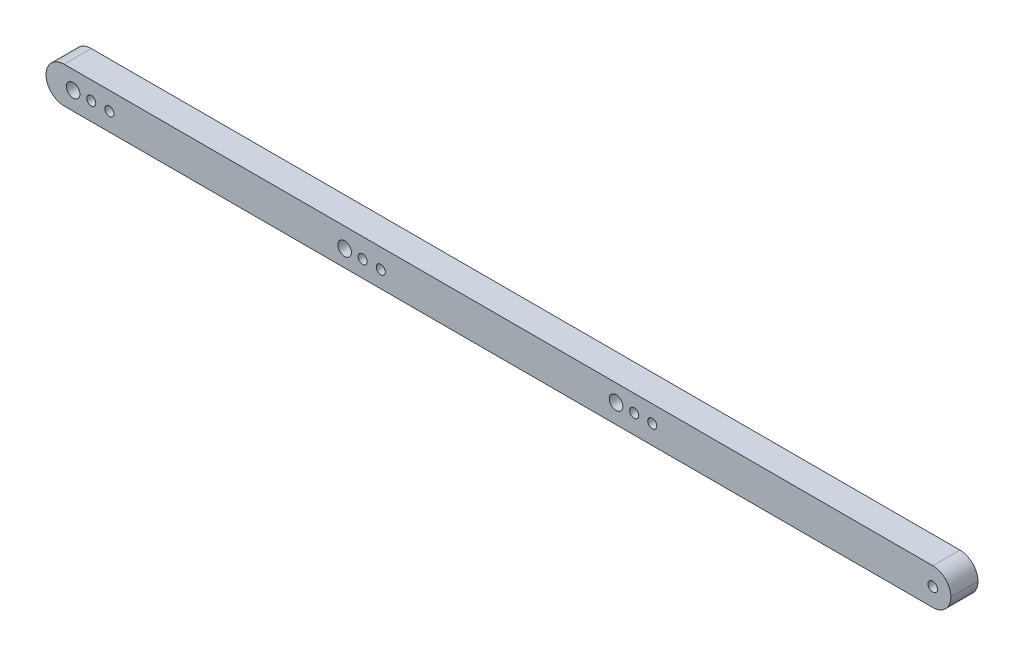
ISO-10303-21;
HEADER;
FILE_DESCRIPTION(('STEP AP214'),'2;1');
FILE_NAME('part.step','',(''),(''),'','','');
FILE_SCHEMA(('AUTOMOTIVE_DESIGN { 1 0 10303 214 1 1 1 1 }'));
ENDSEC;
DATA;
#1=APPLICATION_CONTEXT('core data for automotive mechanical design processes');
#2=APPLICATION_PROTOCOL_DEFINITION('international standard','automotive_design',2000,#1);
#3=PRODUCT_CONTEXT('',#1,'mechanical');
#4=PRODUCT('Part','Part','',(#3));
#5=PRODUCT_RELATED_PRODUCT_CATEGORY('part','',(#4));
#6=PRODUCT_DEFINITION_FORMATION('','',#4);
#7=PRODUCT_DEFINITION_CONTEXT('part definition',#1,'design');
#8=PRODUCT_DEFINITION('design','',#6,#7);
#9=PRODUCT_DEFINITION_SHAPE('','',#8);
#10=(LENGTH_UNIT() NAMED_UNIT(*) SI_UNIT(.MILLI.,.METRE.));
#11=(NAMED_UNIT(*) PLANE_ANGLE_UNIT() SI_UNIT($,.RADIAN.));
#12=(NAMED_UNIT(*) SI_UNIT($,.STERADIAN.) SOLID_ANGLE_UNIT());
#13=UNCERTAINTY_MEASURE_WITH_UNIT(LENGTH_MEASURE(1.E-05),#10,'distance_accuracy_value','');
#14=(GEOMETRIC_REPRESENTATION_CONTEXT(3) GLOBAL_UNCERTAINTY_ASSIGNED_CONTEXT((#13)) GLOBAL_UNIT_ASSIGNED_CONTEXT((#10,
#11,#12)) REPRESENTATION_CONTEXT('',''));
#15=CARTESIAN_POINT('',(0.,0.,0.));
#16=DIRECTION('',(0.,0.,1.));
#17=DIRECTION('',(1.,0.,0.));
#18=AXIS2_PLACEMENT_3D('',#15,#16,#17);
#19=CARTESIAN_POINT('',(0.,8.,6.));
#20=DIRECTION('',(0.,-1.,0.));
#21=DIRECTION('',(1.,0.,0.));
#22=AXIS2_PLACEMENT_3D('',#19,#20,#21);
#23=PLANE('',#22);
#24=DIRECTION('',(-1.,0.,0.));
#25=VECTOR('',#24,1.);
#26=CARTESIAN_POINT('',(0.,8.,0.));
#27=LINE('',#26,#25);
#28=CARTESIAN_POINT('',(-4.,8.,0.));
#29=VERTEX_POINT('',#28);
#30=CARTESIAN_POINT('',(-196.,7.99999999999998,0.));
#31=VERTEX_POINT('',#30);
#32=EDGE_CURVE('E108',#29,#31,#27,.T.);
#33=ORIENTED_EDGE('',*,*,#32,.T.);
#34=DIRECTION('',(0.,0.,-1.));
#35=VECTOR('',#34,1.);
#36=CARTESIAN_POINT('',(-196.,7.99999999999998,6.));
#37=LINE('',#36,#35);
#38=CARTESIAN_POINT('',(-196.,7.99999999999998,6.));
#39=VERTEX_POINT('',#38);
#40=EDGE_CURVE('E11',#31,#39,#37,.F.);
#41=ORIENTED_EDGE('',*,*,#40,.T.);
#42=DIRECTION('',(-1.,0.,0.));
#43=VECTOR('',#42,1.);
#44=CARTESIAN_POINT('',(0.,8.,6.));
#45=LINE('',#44,#43);
#46=CARTESIAN_POINT('',(-4.,8.,6.));
#47=VERTEX_POINT('',#46);
#48=EDGE_CURVE('E107',#47,#39,#45,.T.);
#49=ORIENTED_EDGE('',*,*,#48,.F.);
#50=DIRECTION('',(0.,0.,-1.));
#51=VECTOR('',#50,1.);
#52=CARTESIAN_POINT('',(-4.,8.,6.));
#53=LINE('',#52,#51);
#54=EDGE_CURVE('E35',#47,#29,#53,.T.);
#55=ORIENTED_EDGE('',*,*,#54,.T.);
#56=EDGE_LOOP('',(#33,#41,#49,#55));
#57=FACE_BOUND('',#56,.T.);
#58=ADVANCED_FACE('F28',(#57),#23,.F.);
#59=CARTESIAN_POINT('',(0.,0.,6.));
#60=DIRECTION('',(0.,1.,0.));
#61=DIRECTION('',(-1.,0.,0.));
#62=AXIS2_PLACEMENT_3D('',#59,#60,#61);
#63=PLANE('',#62);
#64=DIRECTION('',(1.,0.,0.));
#65=VECTOR('',#64,1.);
#66=CARTESIAN_POINT('',(0.,0.,6.));
#67=LINE('',#66,#65);
#68=CARTESIAN_POINT('',(-196.,0.,6.));
#69=VERTEX_POINT('',#68);
#70=CARTESIAN_POINT('',(-4.,0.,6.));
#71=VERTEX_POINT('',#70);
#72=EDGE_CURVE('E100',#69,#71,#67,.T.);
#73=ORIENTED_EDGE('',*,*,#72,.F.);
#74=DIRECTION('',(0.,0.,-1.));
#75=VECTOR('',#74,1.);
#76=CARTESIAN_POINT('',(-196.,0.,6.));
#77=LINE('',#76,#75);
#78=CARTESIAN_POINT('',(-196.,0.,0.));
#79=VERTEX_POINT('',#78);
#80=EDGE_CURVE('E84',#69,#79,#77,.T.);
#81=ORIENTED_EDGE('',*,*,#80,.T.);
#82=DIRECTION('',(1.,0.,0.));
#83=VECTOR('',#82,1.);
#84=CARTESIAN_POINT('',(0.,0.,0.));
#85=LINE('',#84,#83);
#86=CARTESIAN_POINT('',(-4.,0.,0.));
#87=VERTEX_POINT('',#86);
#88=EDGE_CURVE('E97',#79,#87,#85,.T.);
#89=ORIENTED_EDGE('',*,*,#88,.T.);
#90=DIRECTION('',(0.,0.,-1.));
#91=VECTOR('',#90,1.);
#92=CARTESIAN_POINT('',(-4.,0.,6.));
#93=LINE('',#92,#91);
#94=EDGE_CURVE('E102',#87,#71,#93,.F.);
#95=ORIENTED_EDGE('',*,*,#94,.T.);
#96=EDGE_LOOP('',(#73,#81,#89,#95));
#97=FACE_BOUND('',#96,.T.);
#98=ADVANCED_FACE('F95',(#97),#63,.F.);
#99=CARTESIAN_POINT('',(0.,8.,6.));
#100=DIRECTION('',(0.,0.,1.));
#101=DIRECTION('',(1.,0.,0.));
#102=AXIS2_PLACEMENT_3D('',#99,#100,#101);
#103=PLANE('',#102);
#104=CARTESIAN_POINT('',(-186.,3.99999999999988,6.));
#105=DIRECTION('',(0.,0.,1.));
#106=DIRECTION('',(1.,0.,0.));
#107=AXIS2_PLACEMENT_3D('',#104,#105,#106);
#108=CIRCLE('',#107,0.999999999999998);
#109=CARTESIAN_POINT('',(-185.,3.99999999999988,6.));
#110=VERTEX_POINT('',#109);
#111=EDGE_CURVE('E197',#110,#110,#108,.T.);
#112=ORIENTED_EDGE('',*,*,#111,.F.);
#113=EDGE_LOOP('',(#112));
#114=FACE_BOUND('',#113,.T.);
#115=CARTESIAN_POINT('',(-190.,3.99999999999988,6.));
#116=DIRECTION('',(0.,0.,1.));
#117=DIRECTION('',(1.,0.,0.));
#118=AXIS2_PLACEMENT_3D('',#115,#116,#117);
#119=CIRCLE('',#118,0.999999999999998);
#120=CARTESIAN_POINT('',(-189.,3.99999999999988,6.));
#121=VERTEX_POINT('',#120);
#122=EDGE_CURVE('E191',#121,#121,#119,.T.);
#123=ORIENTED_EDGE('',*,*,#122,.F.);
#124=EDGE_LOOP('',(#123));
#125=FACE_BOUND('',#124,.T.);
#126=CARTESIAN_POINT('',(-194.,3.99999999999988,6.));
#127=DIRECTION('',(0.,0.,1.));
#128=DIRECTION('',(1.,0.,0.));
#129=AXIS2_PLACEMENT_3D('',#126,#127,#128);
#130=CIRCLE('',#129,1.5);
#131=CARTESIAN_POINT('',(-192.5,3.99999999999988,6.));
#132=VERTEX_POINT('',#131);
#133=EDGE_CURVE('E185',#132,#132,#130,.T.);
#134=ORIENTED_EDGE('',*,*,#133,.F.);
#135=EDGE_LOOP('',(#134));
#136=FACE_BOUND('',#135,.T.);
#137=CARTESIAN_POINT('',(-126.,3.69088872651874,6.));
#138=DIRECTION('',(0.,0.,1.));
#139=DIRECTION('',(1.,0.,0.));
#140=AXIS2_PLACEMENT_3D('',#137,#138,#139);
#141=CIRCLE('',#140,0.999999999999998);
#142=CARTESIAN_POINT('',(-125.,3.69088872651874,6.));
#143=VERTEX_POINT('',#142);
#144=EDGE_CURVE('E179',#143,#143,#141,.T.);
#145=ORIENTED_EDGE('',*,*,#144,.F.);
#146=EDGE_LOOP('',(#145));
#147=FACE_BOUND('',#146,.T.);
#148=CARTESIAN_POINT('',(-130.,3.69088872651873,6.));
#149=DIRECTION('',(0.,0.,1.));
#150=DIRECTION('',(1.,0.,0.));
#151=AXIS2_PLACEMENT_3D('',#148,#149,#150);
#152=CIRCLE('',#151,0.999999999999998);
#153=CARTESIAN_POINT('',(-129.,3.69088872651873,6.));
#154=VERTEX_POINT('',#153);
#155=EDGE_CURVE('E173',#154,#154,#152,.T.);
#156=ORIENTED_EDGE('',*,*,#155,.F.);
#157=EDGE_LOOP('',(#156));
#158=FACE_BOUND('',#157,.T.);
#159=CARTESIAN_POINT('',(-134.,3.69088872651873,6.));
#160=DIRECTION('',(0.,0.,1.));
#161=DIRECTION('',(1.,0.,0.));
#162=AXIS2_PLACEMENT_3D('',#159,#160,#161);
#163=CIRCLE('',#162,1.5);
#164=CARTESIAN_POINT('',(-132.5,3.69088872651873,6.));
#165=VERTEX_POINT('',#164);
#166=EDGE_CURVE('E167',#165,#165,#163,.T.);
#167=ORIENTED_EDGE('',*,*,#166,.F.);
#168=EDGE_LOOP('',(#167));
#169=FACE_BOUND('',#168,.T.);
#170=CARTESIAN_POINT('',(-66.,4.22550524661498,6.));
#171=DIRECTION('',(0.,0.,1.));
#172=DIRECTION('',(1.,0.,0.));
#173=AXIS2_PLACEMENT_3D('',#170,#171,#172);
#174=CIRCLE('',#173,1.00000000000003);
#175=CARTESIAN_POINT('',(-65.,4.22550524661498,6.));
#176=VERTEX_POINT('',#175);
#177=EDGE_CURVE('E161',#176,#176,#174,.T.);
#178=ORIENTED_EDGE('',*,*,#177,.F.);
#179=EDGE_LOOP('',(#178));
#180=FACE_BOUND('',#179,.T.);
#181=CARTESIAN_POINT('',(-70.,4.22550524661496,6.));
#182=DIRECTION('',(0.,0.,1.));
#183=DIRECTION('',(1.,0.,0.));
#184=AXIS2_PLACEMENT_3D('',#181,#182,#183);
#185=CIRCLE('',#184,1.00000000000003);
#186=CARTESIAN_POINT('',(-69.,4.22550524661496,6.));
#187=VERTEX_POINT('',#186);
#188=EDGE_CURVE('E155',#187,#187,#185,.T.);
#189=ORIENTED_EDGE('',*,*,#188,.F.);
#190=EDGE_LOOP('',(#189));
#191=FACE_BOUND('',#190,.T.);
#192=CARTESIAN_POINT('',(-74.,4.22550524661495,6.));
#193=DIRECTION('',(0.,0.,1.));
#194=DIRECTION('',(1.,0.,0.));
#195=AXIS2_PLACEMENT_3D('',#192,#193,#194);
#196=CIRCLE('',#195,1.50000000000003);
#197=CARTESIAN_POINT('',(-72.5,4.22550524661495,6.));
#198=VERTEX_POINT('',#197);
#199=EDGE_CURVE('E149',#198,#198,#196,.T.);
#200=ORIENTED_EDGE('',*,*,#199,.F.);
#201=EDGE_LOOP('',(#200));
#202=FACE_BOUND('',#201,.T.);
#203=CARTESIAN_POINT('',(-4.,4.,6.));
#204=DIRECTION('',(0.,0.,1.));
#205=DIRECTION('',(1.,0.,0.));
#206=AXIS2_PLACEMENT_3D('',#203,#204,#205);
#207=CIRCLE('',#206,1.05);
#208=CARTESIAN_POINT('',(-2.95,4.,6.));
#209=VERTEX_POINT('',#208);
#210=EDGE_CURVE('E143',#209,#209,#207,.T.);
#211=ORIENTED_EDGE('',*,*,#210,.F.);
#212=EDGE_LOOP('',(#211));
#213=FACE_BOUND('',#212,.T.);
#214=CARTESIAN_POINT('',(-196.,3.99999999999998,6.));
#215=DIRECTION('',(0.,0.,1.));
#216=DIRECTION('',(1.,0.,0.));
#217=AXIS2_PLACEMENT_3D('',#214,#215,#216);
#218=CIRCLE('',#217,4.);
#219=CARTESIAN_POINT('',(-200.,3.99999999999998,6.));
#220=VERTEX_POINT('',#219);
#221=EDGE_CURVE('E42',#39,#220,#218,.T.);
#222=ORIENTED_EDGE('',*,*,#221,.T.);
#223=CARTESIAN_POINT('',(-196.,3.99999999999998,6.));
#224=DIRECTION('',(0.,0.,1.));
#225=DIRECTION('',(1.,0.,0.));
#226=AXIS2_PLACEMENT_3D('',#223,#224,#225);
#227=CIRCLE('',#226,4.);
#228=EDGE_CURVE('E123',#220,#69,#227,.T.);
#229=ORIENTED_EDGE('',*,*,#228,.T.);
#230=ORIENTED_EDGE('',*,*,#72,.T.);
#231=CARTESIAN_POINT('',(-4.,4.,6.));
#232=DIRECTION('',(0.,0.,1.));
#233=DIRECTION('',(1.,0.,0.));
#234=AXIS2_PLACEMENT_3D('',#231,#232,#233);
#235=CIRCLE('',#234,4.);
#236=CARTESIAN_POINT('',(0.,4.,6.));
#237=VERTEX_POINT('',#236);
#238=EDGE_CURVE('E120',#71,#237,#235,.T.);
#239=ORIENTED_EDGE('',*,*,#238,.T.);
#240=CARTESIAN_POINT('',(-4.,4.,6.));
#241=DIRECTION('',(0.,0.,1.));
#242=DIRECTION('',(1.,0.,0.));
#243=AXIS2_PLACEMENT_3D('',#240,#241,#242);
#244=CIRCLE('',#243,4.);
#245=EDGE_CURVE('E89',#237,#47,#244,.T.);
#246=ORIENTED_EDGE('',*,*,#245,.T.);
#247=ORIENTED_EDGE('',*,*,#48,.T.);
#248=EDGE_LOOP('',(#222,#229,#230,#239,#246,#247));
#249=FACE_BOUND('',#248,.T.);
#250=ADVANCED_FACE('F137',(#114,#125,#136,#147,#158,#169,#180,#191,#202,#213,#249),#103,.T.);
#251=CARTESIAN_POINT('',(0.,8.,0.));
#252=DIRECTION('',(0.,0.,1.));
#253=DIRECTION('',(1.,0.,0.));
#254=AXIS2_PLACEMENT_3D('',#251,#252,#253);
#255=PLANE('',#254);
#256=CARTESIAN_POINT('',(-186.,3.99999999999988,0.));
#257=DIRECTION('',(0.,0.,1.));
#258=DIRECTION('',(1.,0.,0.));
#259=AXIS2_PLACEMENT_3D('',#256,#257,#258);
#260=CIRCLE('',#259,0.999999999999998);
#261=CARTESIAN_POINT('',(-185.,3.99999999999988,0.));
#262=VERTEX_POINT('',#261);
#263=EDGE_CURVE('E194',#262,#262,#260,.T.);
#264=ORIENTED_EDGE('',*,*,#263,.T.);
#265=EDGE_LOOP('',(#264));
#266=FACE_BOUND('',#265,.T.);
#267=CARTESIAN_POINT('',(-190.,3.99999999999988,0.));
#268=DIRECTION('',(0.,0.,1.));
#269=DIRECTION('',(1.,0.,0.));
#270=AXIS2_PLACEMENT_3D('',#267,#268,#269);
#271=CIRCLE('',#270,0.999999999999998);
#272=CARTESIAN_POINT('',(-189.,3.99999999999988,0.));
#273=VERTEX_POINT('',#272);
#274=EDGE_CURVE('E188',#273,#273,#271,.T.);
#275=ORIENTED_EDGE('',*,*,#274,.T.);
#276=EDGE_LOOP('',(#275));
#277=FACE_BOUND('',#276,.T.);
#278=CARTESIAN_POINT('',(-194.,3.99999999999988,0.));
#279=DIRECTION('',(0.,0.,1.));
#280=DIRECTION('',(1.,0.,0.));
#281=AXIS2_PLACEMENT_3D('',#278,#279,#280);
#282=CIRCLE('',#281,1.5);
#283=CARTESIAN_POINT('',(-192.5,3.99999999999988,0.));
#284=VERTEX_POINT('',#283);
#285=EDGE_CURVE('E182',#284,#284,#282,.T.);
#286=ORIENTED_EDGE('',*,*,#285,.T.);
#287=EDGE_LOOP('',(#286));
#288=FACE_BOUND('',#287,.T.);
#289=CARTESIAN_POINT('',(-126.,3.69088872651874,0.));
#290=DIRECTION('',(0.,0.,1.));
#291=DIRECTION('',(1.,0.,0.));
#292=AXIS2_PLACEMENT_3D('',#289,#290,#291);
#293=CIRCLE('',#292,0.999999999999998);
#294=CARTESIAN_POINT('',(-125.,3.69088872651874,0.));
#295=VERTEX_POINT('',#294);
#296=EDGE_CURVE('E176',#295,#295,#293,.T.);
#297=ORIENTED_EDGE('',*,*,#296,.T.);
#298=EDGE_LOOP('',(#297));
#299=FACE_BOUND('',#298,.T.);
#300=CARTESIAN_POINT('',(-130.,3.69088872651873,0.));
#301=DIRECTION('',(0.,0.,1.));
#302=DIRECTION('',(1.,0.,0.));
#303=AXIS2_PLACEMENT_3D('',#300,#301,#302);
#304=CIRCLE('',#303,0.999999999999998);
#305=CARTESIAN_POINT('',(-129.,3.69088872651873,0.));
#306=VERTEX_POINT('',#305);
#307=EDGE_CURVE('E170',#306,#306,#304,.T.);
#308=ORIENTED_EDGE('',*,*,#307,.T.);
#309=EDGE_LOOP('',(#308));
#310=FACE_BOUND('',#309,.T.);
#311=CARTESIAN_POINT('',(-134.,3.69088872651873,0.));
#312=DIRECTION('',(0.,0.,1.));
#313=DIRECTION('',(1.,0.,0.));
#314=AXIS2_PLACEMENT_3D('',#311,#312,#313);
#315=CIRCLE('',#314,1.5);
#316=CARTESIAN_POINT('',(-132.5,3.69088872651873,0.));
#317=VERTEX_POINT('',#316);
#318=EDGE_CURVE('E164',#317,#317,#315,.T.);
#319=ORIENTED_EDGE('',*,*,#318,.T.);
#320=EDGE_LOOP('',(#319));
#321=FACE_BOUND('',#320,.T.);
#322=CARTESIAN_POINT('',(-66.,4.22550524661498,0.));
#323=DIRECTION('',(0.,0.,1.));
#324=DIRECTION('',(1.,0.,0.));
#325=AXIS2_PLACEMENT_3D('',#322,#323,#324);
#326=CIRCLE('',#325,1.00000000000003);
#327=CARTESIAN_POINT('',(-65.,4.22550524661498,0.));
#328=VERTEX_POINT('',#327);
#329=EDGE_CURVE('E158',#328,#328,#326,.T.);
#330=ORIENTED_EDGE('',*,*,#329,.T.);
#331=EDGE_LOOP('',(#330));
#332=FACE_BOUND('',#331,.T.);
#333=CARTESIAN_POINT('',(-70.,4.22550524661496,0.));
#334=DIRECTION('',(0.,0.,1.));
#335=DIRECTION('',(1.,0.,0.));
#336=AXIS2_PLACEMENT_3D('',#333,#334,#335);
#337=CIRCLE('',#336,1.00000000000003);
#338=CARTESIAN_POINT('',(-69.,4.22550524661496,0.));
#339=VERTEX_POINT('',#338);
#340=EDGE_CURVE('E152',#339,#339,#337,.T.);
#341=ORIENTED_EDGE('',*,*,#340,.T.);
#342=EDGE_LOOP('',(#341));
#343=FACE_BOUND('',#342,.T.);
#344=CARTESIAN_POINT('',(-74.,4.22550524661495,0.));
#345=DIRECTION('',(0.,0.,1.));
#346=DIRECTION('',(1.,0.,0.));
#347=AXIS2_PLACEMENT_3D('',#344,#345,#346);
#348=CIRCLE('',#347,1.50000000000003);
#349=CARTESIAN_POINT('',(-72.5,4.22550524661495,0.));
#350=VERTEX_POINT('',#349);
#351=EDGE_CURVE('E146',#350,#350,#348,.T.);
#352=ORIENTED_EDGE('',*,*,#351,.T.);
#353=EDGE_LOOP('',(#352));
#354=FACE_BOUND('',#353,.T.);
#355=CARTESIAN_POINT('',(-4.,4.,0.));
#356=DIRECTION('',(0.,0.,1.));
#357=DIRECTION('',(1.,0.,0.));
#358=AXIS2_PLACEMENT_3D('',#355,#356,#357);
#359=CIRCLE('',#358,1.05);
#360=CARTESIAN_POINT('',(-2.95,4.,0.));
#361=VERTEX_POINT('',#360);
#362=EDGE_CURVE('E134',#361,#361,#359,.T.);
#363=ORIENTED_EDGE('',*,*,#362,.T.);
#364=EDGE_LOOP('',(#363));
#365=FACE_BOUND('',#364,.T.);
#366=ORIENTED_EDGE('',*,*,#88,.F.);
#367=CARTESIAN_POINT('',(-196.,3.99999999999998,0.));
#368=DIRECTION('',(0.,0.,1.));
#369=DIRECTION('',(1.,0.,0.));
#370=AXIS2_PLACEMENT_3D('',#367,#368,#369);
#371=CIRCLE('',#370,4.);
#372=CARTESIAN_POINT('',(-200.,3.99999999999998,0.));
#373=VERTEX_POINT('',#372);
#374=EDGE_CURVE('E80',#79,#373,#371,.F.);
#375=ORIENTED_EDGE('',*,*,#374,.T.);
#376=CARTESIAN_POINT('',(-196.,3.99999999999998,0.));
#377=DIRECTION('',(0.,0.,1.));
#378=DIRECTION('',(1.,0.,0.));
#379=AXIS2_PLACEMENT_3D('',#376,#377,#378);
#380=CIRCLE('',#379,4.);
#381=EDGE_CURVE('E90',#373,#31,#380,.F.);
#382=ORIENTED_EDGE('',*,*,#381,.T.);
#383=ORIENTED_EDGE('',*,*,#32,.F.);
#384=CARTESIAN_POINT('',(-4.,4.,0.));
#385=DIRECTION('',(0.,0.,1.));
#386=DIRECTION('',(1.,0.,0.));
#387=AXIS2_PLACEMENT_3D('',#384,#385,#386);
#388=CIRCLE('',#387,4.);
#389=CARTESIAN_POINT('',(0.,4.,0.));
#390=VERTEX_POINT('',#389);
#391=EDGE_CURVE('E101',#29,#390,#388,.F.);
#392=ORIENTED_EDGE('',*,*,#391,.T.);
#393=CARTESIAN_POINT('',(-4.,4.,0.));
#394=DIRECTION('',(0.,0.,1.));
#395=DIRECTION('',(1.,0.,0.));
#396=AXIS2_PLACEMENT_3D('',#393,#394,#395);
#397=CIRCLE('',#396,4.);
#398=EDGE_CURVE('E106',#390,#87,#397,.F.);
#399=ORIENTED_EDGE('',*,*,#398,.T.);
#400=EDGE_LOOP('',(#366,#375,#382,#383,#392,#399));
#401=FACE_BOUND('',#400,.T.);
#402=ADVANCED_FACE('F104',(#266,#277,#288,#299,#310,#321,#332,#343,#354,#365,#401),#255,.F.);
#403=CARTESIAN_POINT('',(-196.,3.99999999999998,6.));
#404=DIRECTION('',(0.,0.,-1.));
#405=DIRECTION('',(-1.,0.,0.));
#406=AXIS2_PLACEMENT_3D('',#403,#404,#405);
#407=CYLINDRICAL_SURFACE('',#406,4.);
#408=DIRECTION('',(0.,0.,-1.));
#409=VECTOR('',#408,1.);
#410=CARTESIAN_POINT('',(-200.,3.99999999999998,6.));
#411=LINE('',#410,#409);
#412=EDGE_CURVE('E85',#220,#373,#411,.T.);
#413=ORIENTED_EDGE('',*,*,#412,.F.);
#414=ORIENTED_EDGE('',*,*,#221,.F.);
#415=ORIENTED_EDGE('',*,*,#40,.F.);
#416=ORIENTED_EDGE('',*,*,#381,.F.);
#417=EDGE_LOOP('',(#413,#414,#415,#416));
#418=FACE_BOUND('',#417,.T.);
#419=ADVANCED_FACE('F139',(#418),#407,.T.);
#420=CARTESIAN_POINT('',(-196.,3.99999999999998,6.));
#421=DIRECTION('',(0.,0.,-1.));
#422=DIRECTION('',(-1.,0.,0.));
#423=AXIS2_PLACEMENT_3D('',#420,#421,#422);
#424=CYLINDRICAL_SURFACE('',#423,4.);
#425=ORIENTED_EDGE('',*,*,#228,.F.);
#426=ORIENTED_EDGE('',*,*,#412,.T.);
#427=ORIENTED_EDGE('',*,*,#374,.F.);
#428=ORIENTED_EDGE('',*,*,#80,.F.);
#429=EDGE_LOOP('',(#425,#426,#427,#428));
#430=FACE_BOUND('',#429,.T.);
#431=ADVANCED_FACE('F83',(#430),#424,.T.);
#432=CARTESIAN_POINT('',(-4.,4.,6.));
#433=DIRECTION('',(0.,0.,-1.));
#434=DIRECTION('',(-1.,0.,0.));
#435=AXIS2_PLACEMENT_3D('',#432,#433,#434);
#436=CYLINDRICAL_SURFACE('',#435,4.);
#437=ORIENTED_EDGE('',*,*,#54,.F.);
#438=ORIENTED_EDGE('',*,*,#245,.F.);
#439=DIRECTION('',(0.,0.,-1.));
#440=VECTOR('',#439,1.);
#441=CARTESIAN_POINT('',(0.,4.,6.));
#442=LINE('',#441,#440);
#443=EDGE_CURVE('E132',#390,#237,#442,.F.);
#444=ORIENTED_EDGE('',*,*,#443,.F.);
#445=ORIENTED_EDGE('',*,*,#391,.F.);
#446=EDGE_LOOP('',(#437,#438,#444,#445));
#447=FACE_BOUND('',#446,.T.);
#448=ADVANCED_FACE('F130',(#447),#436,.T.);
#449=CARTESIAN_POINT('',(-4.,4.,6.));
#450=DIRECTION('',(0.,0.,-1.));
#451=DIRECTION('',(-1.,0.,0.));
#452=AXIS2_PLACEMENT_3D('',#449,#450,#451);
#453=CYLINDRICAL_SURFACE('',#452,4.);
#454=ORIENTED_EDGE('',*,*,#238,.F.);
#455=ORIENTED_EDGE('',*,*,#94,.F.);
#456=ORIENTED_EDGE('',*,*,#398,.F.);
#457=ORIENTED_EDGE('',*,*,#443,.T.);
#458=EDGE_LOOP('',(#454,#455,#456,#457));
#459=FACE_BOUND('',#458,.T.);
#460=ADVANCED_FACE('F136',(#459),#453,.T.);
#461=CARTESIAN_POINT('',(-4.,4.,0.));
#462=DIRECTION('',(0.,0.,1.));
#463=DIRECTION('',(1.,0.,0.));
#464=AXIS2_PLACEMENT_3D('',#461,#462,#463);
#465=CYLINDRICAL_SURFACE('',#464,1.05);
#466=ORIENTED_EDGE('',*,*,#362,.F.);
#467=EDGE_LOOP('',(#466));
#468=FACE_BOUND('',#467,.T.);
#469=ORIENTED_EDGE('',*,*,#210,.T.);
#470=EDGE_LOOP('',(#469));
#471=FACE_BOUND('',#470,.T.);
#472=ADVANCED_FACE('F224',(#468,#471),#465,.F.);
#473=CARTESIAN_POINT('',(-74.,4.22550524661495,0.));
#474=DIRECTION('',(0.,0.,1.));
#475=DIRECTION('',(1.,0.,0.));
#476=AXIS2_PLACEMENT_3D('',#473,#474,#475);
#477=CYLINDRICAL_SURFACE('',#476,1.50000000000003);
#478=ORIENTED_EDGE('',*,*,#351,.F.);
#479=EDGE_LOOP('',(#478));
#480=FACE_BOUND('',#479,.T.);
#481=ORIENTED_EDGE('',*,*,#199,.T.);
#482=EDGE_LOOP('',(#481));
#483=FACE_BOUND('',#482,.T.);
#484=ADVANCED_FACE('F226',(#480,#483),#477,.F.);
#485=CARTESIAN_POINT('',(-70.,4.22550524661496,0.));
#486=DIRECTION('',(0.,0.,1.));
#487=DIRECTION('',(1.,0.,0.));
#488=AXIS2_PLACEMENT_3D('',#485,#486,#487);
#489=CYLINDRICAL_SURFACE('',#488,1.00000000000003);
#490=ORIENTED_EDGE('',*,*,#340,.F.);
#491=EDGE_LOOP('',(#490));
#492=FACE_BOUND('',#491,.T.);
#493=ORIENTED_EDGE('',*,*,#188,.T.);
#494=EDGE_LOOP('',(#493));
#495=FACE_BOUND('',#494,.T.);
#496=ADVANCED_FACE('F233',(#492,#495),#489,.F.);
#497=CARTESIAN_POINT('',(-66.,4.22550524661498,0.));
#498=DIRECTION('',(0.,0.,1.));
#499=DIRECTION('',(1.,0.,0.));
#500=AXIS2_PLACEMENT_3D('',#497,#498,#499);
#501=CYLINDRICAL_SURFACE('',#500,1.00000000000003);
#502=ORIENTED_EDGE('',*,*,#329,.F.);
#503=EDGE_LOOP('',(#502));
#504=FACE_BOUND('',#503,.T.);
#505=ORIENTED_EDGE('',*,*,#177,.T.);
#506=EDGE_LOOP('',(#505));
#507=FACE_BOUND('',#506,.T.);
#508=ADVANCED_FACE('F292',(#504,#507),#501,.F.);
#509=CARTESIAN_POINT('',(-134.,3.69088872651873,0.));
#510=DIRECTION('',(0.,0.,1.));
#511=DIRECTION('',(1.,0.,0.));
#512=AXIS2_PLACEMENT_3D('',#509,#510,#511);
#513=CYLINDRICAL_SURFACE('',#512,1.5);
#514=ORIENTED_EDGE('',*,*,#318,.F.);
#515=EDGE_LOOP('',(#514));
#516=FACE_BOUND('',#515,.T.);
#517=ORIENTED_EDGE('',*,*,#166,.T.);
#518=EDGE_LOOP('',(#517));
#519=FACE_BOUND('',#518,.T.);
#520=ADVANCED_FACE('F300',(#516,#519),#513,.F.);
#521=CARTESIAN_POINT('',(-130.,3.69088872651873,0.));
#522=DIRECTION('',(0.,0.,1.));
#523=DIRECTION('',(1.,0.,0.));
#524=AXIS2_PLACEMENT_3D('',#521,#522,#523);
#525=CYLINDRICAL_SURFACE('',#524,0.999999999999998);
#526=ORIENTED_EDGE('',*,*,#307,.F.);
#527=EDGE_LOOP('',(#526));
#528=FACE_BOUND('',#527,.T.);
#529=ORIENTED_EDGE('',*,*,#155,.T.);
#530=EDGE_LOOP('',(#529));
#531=FACE_BOUND('',#530,.T.);
#532=ADVANCED_FACE('F308',(#528,#531),#525,.F.);
#533=CARTESIAN_POINT('',(-126.,3.69088872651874,0.));
#534=DIRECTION('',(0.,0.,1.));
#535=DIRECTION('',(1.,0.,0.));
#536=AXIS2_PLACEMENT_3D('',#533,#534,#535);
#537=CYLINDRICAL_SURFACE('',#536,0.999999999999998);
#538=ORIENTED_EDGE('',*,*,#296,.F.);
#539=EDGE_LOOP('',(#538));
#540=FACE_BOUND('',#539,.T.);
#541=ORIENTED_EDGE('',*,*,#144,.T.);
#542=EDGE_LOOP('',(#541));
#543=FACE_BOUND('',#542,.T.);
#544=ADVANCED_FACE('F316',(#540,#543),#537,.F.);
#545=CARTESIAN_POINT('',(-194.,3.99999999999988,0.));
#546=DIRECTION('',(0.,0.,1.));
#547=DIRECTION('',(1.,0.,0.));
#548=AXIS2_PLACEMENT_3D('',#545,#546,#547);
#549=CYLINDRICAL_SURFACE('',#548,1.5);
#550=ORIENTED_EDGE('',*,*,#285,.F.);
#551=EDGE_LOOP('',(#550));
#552=FACE_BOUND('',#551,.T.);
#553=ORIENTED_EDGE('',*,*,#133,.T.);
#554=EDGE_LOOP('',(#553));
#555=FACE_BOUND('',#554,.T.);
#556=ADVANCED_FACE('F324',(#552,#555),#549,.F.);
#557=CARTESIAN_POINT('',(-190.,3.99999999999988,0.));
#558=DIRECTION('',(0.,0.,1.));
#559=DIRECTION('',(1.,0.,0.));
#560=AXIS2_PLACEMENT_3D('',#557,#558,#559);
#561=CYLINDRICAL_SURFACE('',#560,0.999999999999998);
#562=ORIENTED_EDGE('',*,*,#274,.F.);
#563=EDGE_LOOP('',(#562));
#564=FACE_BOUND('',#563,.T.);
#565=ORIENTED_EDGE('',*,*,#122,.T.);
#566=EDGE_LOOP('',(#565));
#567=FACE_BOUND('',#566,.T.);
#568=ADVANCED_FACE('F332',(#564,#567),#561,.F.);
#569=CARTESIAN_POINT('',(-186.,3.99999999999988,0.));
#570=DIRECTION('',(0.,0.,1.));
#571=DIRECTION('',(1.,0.,0.));
#572=AXIS2_PLACEMENT_3D('',#569,#570,#571);
#573=CYLINDRICAL_SURFACE('',#572,0.999999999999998);
#574=ORIENTED_EDGE('',*,*,#263,.F.);
#575=EDGE_LOOP('',(#574));
#576=FACE_BOUND('',#575,.T.);
#577=ORIENTED_EDGE('',*,*,#111,.T.);
#578=EDGE_LOOP('',(#577));
#579=FACE_BOUND('',#578,.T.);
#580=ADVANCED_FACE('F201',(#576,#579),#573,.F.);
#581=CLOSED_SHELL('',(#58,#98,#250,#402,#419,#431,#448,#460,#472,#484,#496,#508,#520,#532,#544,
#556,#568,#580));
#582=MANIFOLD_SOLID_BREP('B2',#581);
#583=ADVANCED_BREP_SHAPE_REPRESENTATION('',(#18,#582),#14);
#584=SHAPE_DEFINITION_REPRESENTATION(#9,#583);
ENDSEC;
END-ISO-10303-21;
